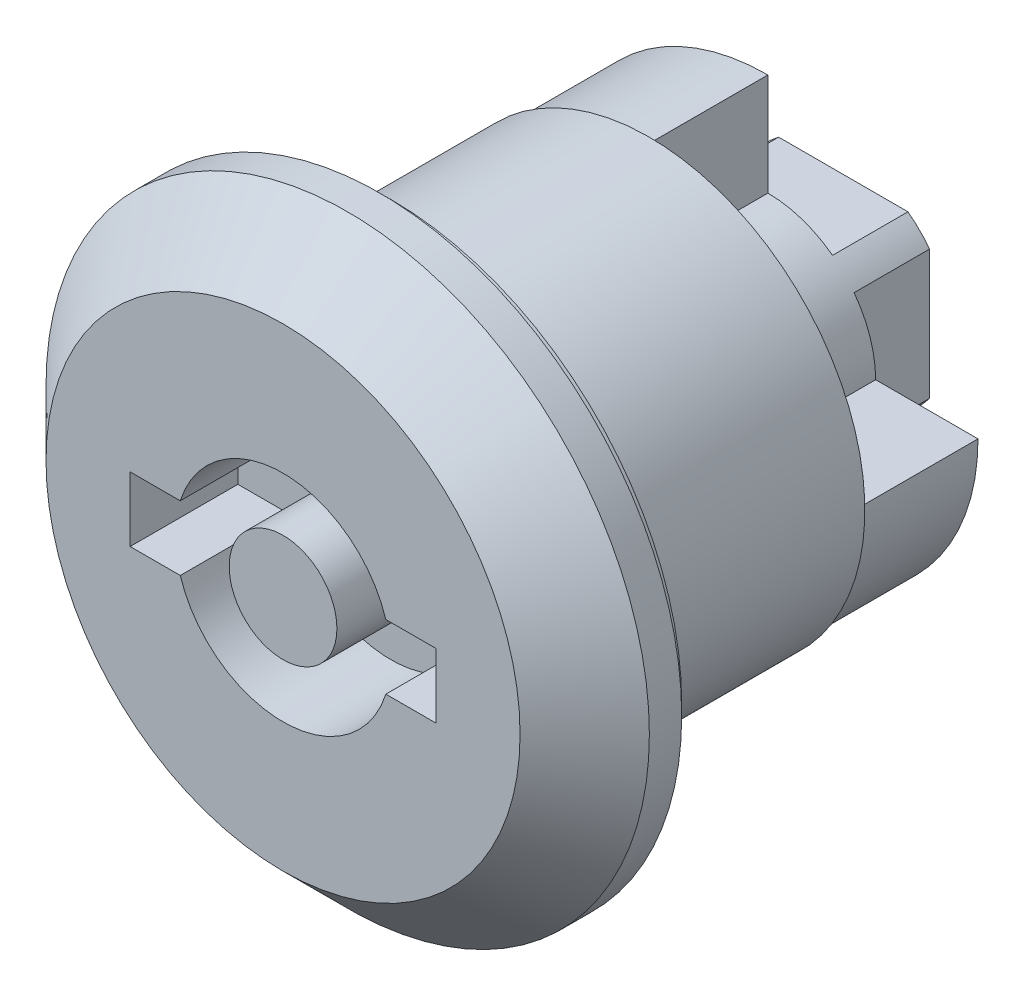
ISO-10303-21;
HEADER;
FILE_DESCRIPTION(('STEP AP214'),'2;1');
FILE_NAME('part.step','',(''),(''),'','','');
FILE_SCHEMA(('AUTOMOTIVE_DESIGN { 1 0 10303 214 1 1 1 1 }'));
ENDSEC;
DATA;
#1=APPLICATION_CONTEXT('core data for automotive mechanical design processes');
#2=APPLICATION_PROTOCOL_DEFINITION('international standard','automotive_design',2000,#1);
#3=PRODUCT_CONTEXT('',#1,'mechanical');
#4=PRODUCT('Part','Part','',(#3));
#5=PRODUCT_RELATED_PRODUCT_CATEGORY('part','',(#4));
#6=PRODUCT_DEFINITION_FORMATION('','',#4);
#7=PRODUCT_DEFINITION_CONTEXT('part definition',#1,'design');
#8=PRODUCT_DEFINITION('design','',#6,#7);
#9=PRODUCT_DEFINITION_SHAPE('','',#8);
#10=(LENGTH_UNIT() NAMED_UNIT(*) SI_UNIT(.MILLI.,.METRE.));
#11=(NAMED_UNIT(*) PLANE_ANGLE_UNIT() SI_UNIT($,.RADIAN.));
#12=(NAMED_UNIT(*) SI_UNIT($,.STERADIAN.) SOLID_ANGLE_UNIT());
#13=UNCERTAINTY_MEASURE_WITH_UNIT(LENGTH_MEASURE(1.E-05),#10,'distance_accuracy_value','');
#14=(GEOMETRIC_REPRESENTATION_CONTEXT(3) GLOBAL_UNCERTAINTY_ASSIGNED_CONTEXT((#13)) GLOBAL_UNIT_ASSIGNED_CONTEXT((#10,
#11,#12)) REPRESENTATION_CONTEXT('',''));
#15=CARTESIAN_POINT('',(0.,0.,0.));
#16=DIRECTION('',(0.,0.,1.));
#17=DIRECTION('',(1.,0.,0.));
#18=AXIS2_PLACEMENT_3D('',#15,#16,#17);
#19=CARTESIAN_POINT('',(0.,0.,-50.));
#20=DIRECTION('',(0.,0.,-1.));
#21=DIRECTION('',(-1.,0.,0.));
#22=AXIS2_PLACEMENT_3D('',#19,#20,#21);
#23=CYLINDRICAL_SURFACE('',#22,5.);
#24=CARTESIAN_POINT('',(0.,0.,-17.5));
#25=DIRECTION('',(0.,0.,-1.));
#26=DIRECTION('',(-1.,0.,0.));
#27=AXIS2_PLACEMENT_3D('',#24,#25,#26);
#28=CIRCLE('',#27,5.);
#29=CARTESIAN_POINT('',(-4.,3.,-17.5));
#30=VERTEX_POINT('',#29);
#31=CARTESIAN_POINT('',(-3.,4.,-17.5));
#32=VERTEX_POINT('',#31);
#33=EDGE_CURVE('E272',#30,#32,#28,.T.);
#34=ORIENTED_EDGE('',*,*,#33,.T.);
#35=DIRECTION('',(0.,0.,-1.));
#36=VECTOR('',#35,1.);
#37=CARTESIAN_POINT('',(-3.,4.,-11.4172374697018));
#38=LINE('',#37,#36);
#39=CARTESIAN_POINT('',(-3.,4.,-21.));
#40=VERTEX_POINT('',#39);
#41=EDGE_CURVE('E292',#32,#40,#38,.T.);
#42=ORIENTED_EDGE('',*,*,#41,.T.);
#43=CARTESIAN_POINT('',(0.,0.,-21.));
#44=DIRECTION('',(0.,0.,-1.));
#45=DIRECTION('',(-1.,0.,0.));
#46=AXIS2_PLACEMENT_3D('',#43,#44,#45);
#47=CIRCLE('',#46,5.);
#48=CARTESIAN_POINT('',(-4.,3.,-21.));
#49=VERTEX_POINT('',#48);
#50=EDGE_CURVE('E276',#49,#40,#47,.T.);
#51=ORIENTED_EDGE('',*,*,#50,.F.);
#52=DIRECTION('',(0.,0.,-1.));
#53=VECTOR('',#52,1.);
#54=CARTESIAN_POINT('',(-4.,3.,-11.4172374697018));
#55=LINE('',#54,#53);
#56=EDGE_CURVE('E289',#30,#49,#55,.T.);
#57=ORIENTED_EDGE('',*,*,#56,.F.);
#58=EDGE_LOOP('',(#34,#42,#51,#57));
#59=FACE_BOUND('',#58,.T.);
#60=ADVANCED_FACE('F14',(#59),#23,.T.);
#61=DIRECTION('',(0.,0.,-1.));
#62=VECTOR('',#61,1.);
#63=CARTESIAN_POINT('',(-3.,-4.,-11.4172374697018));
#64=LINE('',#63,#62);
#65=CARTESIAN_POINT('',(-3.,-4.,-17.5));
#66=VERTEX_POINT('',#65);
#67=CARTESIAN_POINT('',(-3.,-4.,-21.));
#68=VERTEX_POINT('',#67);
#69=EDGE_CURVE('E263',#66,#68,#64,.T.);
#70=ORIENTED_EDGE('',*,*,#69,.F.);
#71=CARTESIAN_POINT('',(-4.,-3.,-17.5));
#72=VERTEX_POINT('',#71);
#73=EDGE_CURVE('E277',#66,#72,#28,.T.);
#74=ORIENTED_EDGE('',*,*,#73,.T.);
#75=DIRECTION('',(0.,0.,-1.));
#76=VECTOR('',#75,1.);
#77=CARTESIAN_POINT('',(-4.,-3.,-11.4172374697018));
#78=LINE('',#77,#76);
#79=CARTESIAN_POINT('',(-4.,-3.,-21.));
#80=VERTEX_POINT('',#79);
#81=EDGE_CURVE('E310',#72,#80,#78,.T.);
#82=ORIENTED_EDGE('',*,*,#81,.T.);
#83=EDGE_CURVE('E273',#68,#80,#47,.T.);
#84=ORIENTED_EDGE('',*,*,#83,.F.);
#85=EDGE_LOOP('',(#70,#74,#82,#84));
#86=FACE_BOUND('',#85,.T.);
#87=ADVANCED_FACE('F221',(#86),#23,.T.);
#88=DIRECTION('',(0.,0.,-1.));
#89=VECTOR('',#88,1.);
#90=CARTESIAN_POINT('',(3.,-4.,-11.4172374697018));
#91=LINE('',#90,#89);
#92=CARTESIAN_POINT('',(3.,-4.,-17.5));
#93=VERTEX_POINT('',#92);
#94=CARTESIAN_POINT('',(3.,-4.,-21.));
#95=VERTEX_POINT('',#94);
#96=EDGE_CURVE('E255',#93,#95,#91,.T.);
#97=ORIENTED_EDGE('',*,*,#96,.T.);
#98=CARTESIAN_POINT('',(4.,-3.,-21.));
#99=VERTEX_POINT('',#98);
#100=EDGE_CURVE('E258',#99,#95,#47,.T.);
#101=ORIENTED_EDGE('',*,*,#100,.F.);
#102=DIRECTION('',(0.,0.,-1.));
#103=VECTOR('',#102,1.);
#104=CARTESIAN_POINT('',(4.,-3.,-11.4172374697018));
#105=LINE('',#104,#103);
#106=CARTESIAN_POINT('',(4.,-3.,-17.5));
#107=VERTEX_POINT('',#106);
#108=EDGE_CURVE('E314',#107,#99,#105,.T.);
#109=ORIENTED_EDGE('',*,*,#108,.F.);
#110=EDGE_CURVE('E260',#107,#93,#28,.T.);
#111=ORIENTED_EDGE('',*,*,#110,.T.);
#112=EDGE_LOOP('',(#97,#101,#109,#111));
#113=FACE_BOUND('',#112,.T.);
#114=ADVANCED_FACE('F229',(#113),#23,.T.);
#115=CARTESIAN_POINT('',(0.,5.,-21.));
#116=DIRECTION('',(0.,0.,1.));
#117=DIRECTION('',(1.,0.,0.));
#118=AXIS2_PLACEMENT_3D('',#115,#116,#117);
#119=PLANE('',#118);
#120=CARTESIAN_POINT('',(0.,0.,-21.));
#121=DIRECTION('',(0.,0.,-1.));
#122=DIRECTION('',(-1.,0.,0.));
#123=AXIS2_PLACEMENT_3D('',#120,#121,#122);
#124=CIRCLE('',#123,3.);
#125=CARTESIAN_POINT('',(-3.,0.,-21.));
#126=VERTEX_POINT('',#125);
#127=EDGE_CURVE('E427',#126,#126,#124,.T.);
#128=ORIENTED_EDGE('',*,*,#127,.F.);
#129=EDGE_LOOP('',(#128));
#130=FACE_BOUND('',#129,.T.);
#131=ORIENTED_EDGE('',*,*,#50,.T.);
#132=DIRECTION('',(-1.,0.,0.));
#133=VECTOR('',#132,1.);
#134=CARTESIAN_POINT('',(3.,4.,-21.));
#135=LINE('',#134,#133);
#136=CARTESIAN_POINT('',(3.,4.,-21.));
#137=VERTEX_POINT('',#136);
#138=EDGE_CURVE('E284',#137,#40,#135,.T.);
#139=ORIENTED_EDGE('',*,*,#138,.F.);
#140=CARTESIAN_POINT('',(4.,3.,-21.));
#141=VERTEX_POINT('',#140);
#142=EDGE_CURVE('E275',#137,#141,#47,.T.);
#143=ORIENTED_EDGE('',*,*,#142,.T.);
#144=DIRECTION('',(0.,-1.,0.));
#145=VECTOR('',#144,1.);
#146=CARTESIAN_POINT('',(4.,3.,-21.));
#147=LINE('',#146,#145);
#148=EDGE_CURVE('E271',#141,#99,#147,.T.);
#149=ORIENTED_EDGE('',*,*,#148,.T.);
#150=ORIENTED_EDGE('',*,*,#100,.T.);
#151=DIRECTION('',(-1.,0.,0.));
#152=VECTOR('',#151,1.);
#153=CARTESIAN_POINT('',(3.,-4.,-21.));
#154=LINE('',#153,#152);
#155=EDGE_CURVE('E262',#95,#68,#154,.T.);
#156=ORIENTED_EDGE('',*,*,#155,.T.);
#157=ORIENTED_EDGE('',*,*,#83,.T.);
#158=DIRECTION('',(0.,-1.,0.));
#159=VECTOR('',#158,1.);
#160=CARTESIAN_POINT('',(-4.,3.,-21.));
#161=LINE('',#160,#159);
#162=EDGE_CURVE('E286',#49,#80,#161,.T.);
#163=ORIENTED_EDGE('',*,*,#162,.F.);
#164=EDGE_LOOP('',(#131,#139,#143,#149,#150,#156,#157,#163));
#165=FACE_BOUND('',#164,.T.);
#166=ADVANCED_FACE('F235',(#130,#165),#119,.F.);
#167=ORIENTED_EDGE('',*,*,#142,.F.);
#168=DIRECTION('',(0.,0.,-1.));
#169=VECTOR('',#168,1.);
#170=CARTESIAN_POINT('',(3.,4.,-11.4172374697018));
#171=LINE('',#170,#169);
#172=CARTESIAN_POINT('',(3.,4.,-17.5));
#173=VERTEX_POINT('',#172);
#174=EDGE_CURVE('E295',#173,#137,#171,.T.);
#175=ORIENTED_EDGE('',*,*,#174,.F.);
#176=CARTESIAN_POINT('',(0.,0.,-17.5));
#177=DIRECTION('',(0.,0.,-1.));
#178=DIRECTION('',(-1.,0.,0.));
#179=AXIS2_PLACEMENT_3D('',#176,#177,#178);
#180=CIRCLE('',#179,5.);
#181=CARTESIAN_POINT('',(0.,5.,-17.5));
#182=VERTEX_POINT('',#181);
#183=EDGE_CURVE('E448',#182,#173,#180,.T.);
#184=ORIENTED_EDGE('',*,*,#183,.F.);
#185=DIRECTION('',(0.,0.,-1.));
#186=VECTOR('',#185,1.);
#187=CARTESIAN_POINT('',(0.,5.,1.78858223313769));
#188=LINE('',#187,#186);
#189=CARTESIAN_POINT('',(0.,5.,-12.));
#190=VERTEX_POINT('',#189);
#191=EDGE_CURVE('E462',#190,#182,#188,.T.);
#192=ORIENTED_EDGE('',*,*,#191,.F.);
#193=CARTESIAN_POINT('',(0.,0.,-12.));
#194=DIRECTION('',(0.,0.,1.));
#195=DIRECTION('',(1.,0.,0.));
#196=AXIS2_PLACEMENT_3D('',#193,#194,#195);
#197=CIRCLE('',#196,5.);
#198=CARTESIAN_POINT('',(5.,0.,-12.));
#199=VERTEX_POINT('',#198);
#200=EDGE_CURVE('E446',#190,#199,#197,.F.);
#201=ORIENTED_EDGE('',*,*,#200,.T.);
#202=DIRECTION('',(0.,0.,-1.));
#203=VECTOR('',#202,1.);
#204=CARTESIAN_POINT('',(5.,0.,1.78858223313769));
#205=LINE('',#204,#203);
#206=CARTESIAN_POINT('',(5.,0.,-17.5));
#207=VERTEX_POINT('',#206);
#208=EDGE_CURVE('E450',#199,#207,#205,.T.);
#209=ORIENTED_EDGE('',*,*,#208,.T.);
#210=CARTESIAN_POINT('',(4.,3.,-17.5));
#211=VERTEX_POINT('',#210);
#212=EDGE_CURVE('E451',#211,#207,#180,.T.);
#213=ORIENTED_EDGE('',*,*,#212,.F.);
#214=DIRECTION('',(0.,0.,-1.));
#215=VECTOR('',#214,1.);
#216=CARTESIAN_POINT('',(4.,3.,-11.4172374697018));
#217=LINE('',#216,#215);
#218=EDGE_CURVE('E317',#211,#141,#217,.T.);
#219=ORIENTED_EDGE('',*,*,#218,.T.);
#220=EDGE_LOOP('',(#167,#175,#184,#192,#201,#209,#213,#219));
#221=FACE_BOUND('',#220,.T.);
#222=ADVANCED_FACE('F224',(#221),#23,.T.);
#223=CARTESIAN_POINT('',(0.,0.,-50.));
#224=DIRECTION('',(0.,0.,-1.));
#225=DIRECTION('',(-1.,0.,0.));
#226=AXIS2_PLACEMENT_3D('',#223,#224,#225);
#227=CYLINDRICAL_SURFACE('',#226,10.);
#228=CARTESIAN_POINT('',(0.,0.,-12.));
#229=DIRECTION('',(0.,0.,-1.));
#230=DIRECTION('',(-1.,0.,0.));
#231=AXIS2_PLACEMENT_3D('',#228,#229,#230);
#232=CIRCLE('',#231,10.);
#233=CARTESIAN_POINT('',(-10.,0.,-12.));
#234=VERTEX_POINT('',#233);
#235=EDGE_CURVE('E9',#234,#234,#232,.T.);
#236=ORIENTED_EDGE('',*,*,#235,.F.);
#237=EDGE_LOOP('',(#236));
#238=FACE_BOUND('',#237,.T.);
#239=CARTESIAN_POINT('',(0.,0.,0.));
#240=DIRECTION('',(0.,0.,-1.));
#241=DIRECTION('',(-1.,0.,0.));
#242=AXIS2_PLACEMENT_3D('',#239,#240,#241);
#243=CIRCLE('',#242,10.);
#244=CARTESIAN_POINT('',(-10.,0.,0.));
#245=VERTEX_POINT('',#244);
#246=EDGE_CURVE('E319',#245,#245,#243,.T.);
#247=ORIENTED_EDGE('',*,*,#246,.T.);
#248=EDGE_LOOP('',(#247));
#249=FACE_BOUND('',#248,.T.);
#250=ADVANCED_FACE('F16',(#238,#249),#227,.T.);
#251=CARTESIAN_POINT('',(0.,10.,-12.));
#252=DIRECTION('',(0.,0.,1.));
#253=DIRECTION('',(1.,0.,0.));
#254=AXIS2_PLACEMENT_3D('',#251,#252,#253);
#255=PLANE('',#254);
#256=CARTESIAN_POINT('',(0.,0.,-12.));
#257=DIRECTION('',(0.,0.,-1.));
#258=DIRECTION('',(-1.,0.,0.));
#259=AXIS2_PLACEMENT_3D('',#256,#257,#258);
#260=CIRCLE('',#259,9.75);
#261=CARTESIAN_POINT('',(9.75,0.,-12.));
#262=VERTEX_POINT('',#261);
#263=CARTESIAN_POINT('',(0.,9.75,-12.));
#264=VERTEX_POINT('',#263);
#265=EDGE_CURVE('E22',#262,#264,#260,.T.);
#266=ORIENTED_EDGE('',*,*,#265,.F.);
#267=DIRECTION('',(1.,0.,0.));
#268=VECTOR('',#267,1.);
#269=CARTESIAN_POINT('',(5.,0.,-12.));
#270=LINE('',#269,#268);
#271=EDGE_CURVE('E455',#199,#262,#270,.T.);
#272=ORIENTED_EDGE('',*,*,#271,.F.);
#273=ORIENTED_EDGE('',*,*,#200,.F.);
#274=DIRECTION('',(0.,1.,0.));
#275=VECTOR('',#274,1.);
#276=CARTESIAN_POINT('',(0.,5.,-12.));
#277=LINE('',#276,#275);
#278=EDGE_CURVE('E456',#190,#264,#277,.T.);
#279=ORIENTED_EDGE('',*,*,#278,.T.);
#280=EDGE_LOOP('',(#266,#272,#273,#279));
#281=FACE_BOUND('',#280,.T.);
#282=ORIENTED_EDGE('',*,*,#235,.T.);
#283=EDGE_LOOP('',(#282));
#284=FACE_BOUND('',#283,.T.);
#285=ADVANCED_FACE('F242',(#281,#284),#255,.F.);
#286=CARTESIAN_POINT('',(0.,0.,-50.));
#287=DIRECTION('',(0.,0.,-1.));
#288=DIRECTION('',(-1.,0.,0.));
#289=AXIS2_PLACEMENT_3D('',#286,#287,#288);
#290=CYLINDRICAL_SURFACE('',#289,9.75);
#291=ORIENTED_EDGE('',*,*,#265,.T.);
#292=DIRECTION('',(0.,0.,-1.));
#293=VECTOR('',#292,1.);
#294=CARTESIAN_POINT('',(0.,9.75,1.78858223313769));
#295=LINE('',#294,#293);
#296=CARTESIAN_POINT('',(0.,9.75,-17.5));
#297=VERTEX_POINT('',#296);
#298=EDGE_CURVE('E458',#264,#297,#295,.T.);
#299=ORIENTED_EDGE('',*,*,#298,.T.);
#300=CARTESIAN_POINT('',(0.,0.,-17.5));
#301=DIRECTION('',(0.,0.,-1.));
#302=DIRECTION('',(-1.,0.,0.));
#303=AXIS2_PLACEMENT_3D('',#300,#301,#302);
#304=CIRCLE('',#303,9.75);
#305=CARTESIAN_POINT('',(9.75,0.,-17.5));
#306=VERTEX_POINT('',#305);
#307=EDGE_CURVE('E474',#306,#297,#304,.T.);
#308=ORIENTED_EDGE('',*,*,#307,.F.);
#309=DIRECTION('',(0.,0.,-1.));
#310=VECTOR('',#309,1.);
#311=CARTESIAN_POINT('',(9.75,0.,1.78858223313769));
#312=LINE('',#311,#310);
#313=EDGE_CURVE('E37',#262,#306,#312,.T.);
#314=ORIENTED_EDGE('',*,*,#313,.F.);
#315=EDGE_LOOP('',(#291,#299,#308,#314));
#316=FACE_BOUND('',#315,.T.);
#317=ADVANCED_FACE('F350',(#316),#290,.T.);
#318=CARTESIAN_POINT('',(0.,9.75,-17.5));
#319=DIRECTION('',(0.,0.,1.));
#320=DIRECTION('',(1.,0.,0.));
#321=AXIS2_PLACEMENT_3D('',#318,#319,#320);
#322=PLANE('',#321);
#323=ORIENTED_EDGE('',*,*,#307,.T.);
#324=DIRECTION('',(0.,1.,0.));
#325=VECTOR('',#324,1.);
#326=CARTESIAN_POINT('',(0.,5.,-17.5));
#327=LINE('',#326,#325);
#328=EDGE_CURVE('E444',#182,#297,#327,.T.);
#329=ORIENTED_EDGE('',*,*,#328,.F.);
#330=ORIENTED_EDGE('',*,*,#183,.T.);
#331=DIRECTION('',(-1.,0.,0.));
#332=VECTOR('',#331,1.);
#333=CARTESIAN_POINT('',(3.,4.,-17.5));
#334=LINE('',#333,#332);
#335=EDGE_CURVE('E296',#173,#32,#334,.T.);
#336=ORIENTED_EDGE('',*,*,#335,.T.);
#337=ORIENTED_EDGE('',*,*,#33,.F.);
#338=DIRECTION('',(0.,-1.,0.));
#339=VECTOR('',#338,1.);
#340=CARTESIAN_POINT('',(-4.,3.,-17.5));
#341=LINE('',#340,#339);
#342=EDGE_CURVE('E307',#30,#72,#341,.T.);
#343=ORIENTED_EDGE('',*,*,#342,.T.);
#344=ORIENTED_EDGE('',*,*,#73,.F.);
#345=DIRECTION('',(-1.,0.,0.));
#346=VECTOR('',#345,1.);
#347=CARTESIAN_POINT('',(3.,-4.,-17.5));
#348=LINE('',#347,#346);
#349=EDGE_CURVE('E303',#93,#66,#348,.T.);
#350=ORIENTED_EDGE('',*,*,#349,.F.);
#351=ORIENTED_EDGE('',*,*,#110,.F.);
#352=DIRECTION('',(0.,-1.,0.));
#353=VECTOR('',#352,1.);
#354=CARTESIAN_POINT('',(4.,3.,-17.5));
#355=LINE('',#354,#353);
#356=EDGE_CURVE('E316',#211,#107,#355,.T.);
#357=ORIENTED_EDGE('',*,*,#356,.F.);
#358=ORIENTED_EDGE('',*,*,#212,.T.);
#359=DIRECTION('',(1.,0.,0.));
#360=VECTOR('',#359,1.);
#361=CARTESIAN_POINT('',(5.,0.,-17.5));
#362=LINE('',#361,#360);
#363=EDGE_CURVE('E447',#207,#306,#362,.T.);
#364=ORIENTED_EDGE('',*,*,#363,.T.);
#365=EDGE_LOOP('',(#323,#329,#330,#336,#337,#343,#344,#350,#351,#357,#358,#364));
#366=FACE_BOUND('',#365,.T.);
#367=ADVANCED_FACE('F341',(#366),#322,.F.);
#368=CARTESIAN_POINT('',(0.,11.,5.));
#369=DIRECTION('',(0.,0.,1.));
#370=DIRECTION('',(1.,0.,0.));
#371=AXIS2_PLACEMENT_3D('',#368,#369,#370);
#372=PLANE('',#371);
#373=DIRECTION('',(0.,-1.,0.));
#374=VECTOR('',#373,1.);
#375=CARTESIAN_POINT('',(-7.095,1.5,5.));
#376=LINE('',#375,#374);
#377=CARTESIAN_POINT('',(-7.095,1.5,5.));
#378=VERTEX_POINT('',#377);
#379=CARTESIAN_POINT('',(-7.095,-1.5,5.));
#380=VERTEX_POINT('',#379);
#381=EDGE_CURVE('E29',#378,#380,#376,.T.);
#382=ORIENTED_EDGE('',*,*,#381,.F.);
#383=DIRECTION('',(1.,0.,0.));
#384=VECTOR('',#383,1.);
#385=CARTESIAN_POINT('',(-7.095,1.5,5.));
#386=LINE('',#385,#384);
#387=CARTESIAN_POINT('',(-4.76969600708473,1.5,5.));
#388=VERTEX_POINT('',#387);
#389=EDGE_CURVE('E183',#378,#388,#386,.T.);
#390=ORIENTED_EDGE('',*,*,#389,.T.);
#391=CARTESIAN_POINT('',(0.,0.,5.));
#392=DIRECTION('',(0.,0.,1.));
#393=DIRECTION('',(1.,0.,0.));
#394=AXIS2_PLACEMENT_3D('',#391,#392,#393);
#395=CIRCLE('',#394,5.);
#396=CARTESIAN_POINT('',(4.76969600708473,1.5,5.));
#397=VERTEX_POINT('',#396);
#398=EDGE_CURVE('E177',#397,#388,#395,.T.);
#399=ORIENTED_EDGE('',*,*,#398,.F.);
#400=DIRECTION('',(1.,0.,0.));
#401=VECTOR('',#400,1.);
#402=CARTESIAN_POINT('',(4.76969600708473,1.5,5.));
#403=LINE('',#402,#401);
#404=CARTESIAN_POINT('',(7.095,1.5,5.));
#405=VERTEX_POINT('',#404);
#406=EDGE_CURVE('E184',#397,#405,#403,.T.);
#407=ORIENTED_EDGE('',*,*,#406,.T.);
#408=DIRECTION('',(0.,1.,0.));
#409=VECTOR('',#408,1.);
#410=CARTESIAN_POINT('',(7.095,-1.5,5.));
#411=LINE('',#410,#409);
#412=CARTESIAN_POINT('',(7.095,-1.5,5.));
#413=VERTEX_POINT('',#412);
#414=EDGE_CURVE('E178',#413,#405,#411,.T.);
#415=ORIENTED_EDGE('',*,*,#414,.F.);
#416=DIRECTION('',(-1.,0.,0.));
#417=VECTOR('',#416,1.);
#418=CARTESIAN_POINT('',(7.095,-1.5,5.));
#419=LINE('',#418,#417);
#420=CARTESIAN_POINT('',(4.76969600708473,-1.5,5.));
#421=VERTEX_POINT('',#420);
#422=EDGE_CURVE('E175',#413,#421,#419,.T.);
#423=ORIENTED_EDGE('',*,*,#422,.T.);
#424=CARTESIAN_POINT('',(-4.76969600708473,-1.5,5.));
#425=VERTEX_POINT('',#424);
#426=EDGE_CURVE('E156',#425,#421,#395,.T.);
#427=ORIENTED_EDGE('',*,*,#426,.F.);
#428=DIRECTION('',(-1.,0.,0.));
#429=VECTOR('',#428,1.);
#430=CARTESIAN_POINT('',(-4.76969600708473,-1.5,5.));
#431=LINE('',#430,#429);
#432=EDGE_CURVE('E167',#425,#380,#431,.T.);
#433=ORIENTED_EDGE('',*,*,#432,.T.);
#434=EDGE_LOOP('',(#382,#390,#399,#407,#415,#423,#427,#433));
#435=FACE_BOUND('',#434,.T.);
#436=CARTESIAN_POINT('',(0.,0.,5.));
#437=DIRECTION('',(0.,0.,-1.));
#438=DIRECTION('',(-1.,0.,0.));
#439=AXIS2_PLACEMENT_3D('',#436,#437,#438);
#440=CIRCLE('',#439,11.);
#441=CARTESIAN_POINT('',(-11.,0.,5.));
#442=VERTEX_POINT('',#441);
#443=EDGE_CURVE('E280',#442,#442,#440,.T.);
#444=ORIENTED_EDGE('',*,*,#443,.F.);
#445=EDGE_LOOP('',(#444));
#446=FACE_BOUND('',#445,.T.);
#447=ADVANCED_FACE('F171',(#435,#446),#372,.T.);
#448=CARTESIAN_POINT('',(0.,0.,5.));
#449=DIRECTION('',(0.,0.,-1.));
#450=DIRECTION('',(-1.,0.,0.));
#451=AXIS2_PLACEMENT_3D('',#448,#449,#450);
#452=CONICAL_SURFACE('',#451,11.,0.785398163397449);
#453=CARTESIAN_POINT('',(0.,0.,2.));
#454=DIRECTION('',(0.,0.,-1.));
#455=DIRECTION('',(-1.,0.,0.));
#456=AXIS2_PLACEMENT_3D('',#453,#454,#455);
#457=CIRCLE('',#456,14.);
#458=CARTESIAN_POINT('',(-14.,0.,2.));
#459=VERTEX_POINT('',#458);
#460=EDGE_CURVE('E334',#459,#459,#457,.T.);
#461=ORIENTED_EDGE('',*,*,#460,.F.);
#462=EDGE_LOOP('',(#461));
#463=FACE_BOUND('',#462,.T.);
#464=ORIENTED_EDGE('',*,*,#443,.T.);
#465=EDGE_LOOP('',(#464));
#466=FACE_BOUND('',#465,.T.);
#467=ADVANCED_FACE('F339',(#463,#466),#452,.T.);
#468=CARTESIAN_POINT('',(0.,0.,-50.));
#469=DIRECTION('',(0.,0.,-1.));
#470=DIRECTION('',(-1.,0.,0.));
#471=AXIS2_PLACEMENT_3D('',#468,#469,#470);
#472=CYLINDRICAL_SURFACE('',#471,14.);
#473=CARTESIAN_POINT('',(0.,0.,0.500000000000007));
#474=DIRECTION('',(0.,0.,-1.));
#475=DIRECTION('',(-1.,0.,0.));
#476=AXIS2_PLACEMENT_3D('',#473,#474,#475);
#477=CIRCLE('',#476,14.);
#478=CARTESIAN_POINT('',(-14.,0.,0.500000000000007));
#479=VERTEX_POINT('',#478);
#480=EDGE_CURVE('E331',#479,#479,#477,.T.);
#481=ORIENTED_EDGE('',*,*,#480,.F.);
#482=EDGE_LOOP('',(#481));
#483=FACE_BOUND('',#482,.T.);
#484=ORIENTED_EDGE('',*,*,#460,.T.);
#485=EDGE_LOOP('',(#484));
#486=FACE_BOUND('',#485,.T.);
#487=ADVANCED_FACE('F347',(#483,#486),#472,.T.);
#488=CARTESIAN_POINT('',(0.,14.,0.50000000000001));
#489=DIRECTION('',(0.,0.,1.));
#490=DIRECTION('',(1.,0.,0.));
#491=AXIS2_PLACEMENT_3D('',#488,#489,#490);
#492=PLANE('',#491);
#493=CARTESIAN_POINT('',(0.,0.,0.500000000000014));
#494=DIRECTION('',(0.,0.,-1.));
#495=DIRECTION('',(-1.,0.,0.));
#496=AXIS2_PLACEMENT_3D('',#493,#494,#495);
#497=CIRCLE('',#496,13.5);
#498=CARTESIAN_POINT('',(-13.5,0.,0.500000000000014));
#499=VERTEX_POINT('',#498);
#500=EDGE_CURVE('E328',#499,#499,#497,.T.);
#501=ORIENTED_EDGE('',*,*,#500,.F.);
#502=EDGE_LOOP('',(#501));
#503=FACE_BOUND('',#502,.T.);
#504=ORIENTED_EDGE('',*,*,#480,.T.);
#505=EDGE_LOOP('',(#504));
#506=FACE_BOUND('',#505,.T.);
#507=ADVANCED_FACE('F355',(#503,#506),#492,.F.);
#508=CARTESIAN_POINT('',(0.,0.,-50.));
#509=DIRECTION('',(0.,0.,-1.));
#510=DIRECTION('',(-1.,0.,0.));
#511=AXIS2_PLACEMENT_3D('',#508,#509,#510);
#512=CYLINDRICAL_SURFACE('',#511,13.5);
#513=ORIENTED_EDGE('',*,*,#500,.T.);
#514=EDGE_LOOP('',(#513));
#515=FACE_BOUND('',#514,.T.);
#516=CARTESIAN_POINT('',(0.,0.,0.));
#517=DIRECTION('',(0.,0.,-1.));
#518=DIRECTION('',(-1.,0.,0.));
#519=AXIS2_PLACEMENT_3D('',#516,#517,#518);
#520=CIRCLE('',#519,13.5);
#521=CARTESIAN_POINT('',(-13.5,0.,0.));
#522=VERTEX_POINT('',#521);
#523=EDGE_CURVE('E325',#522,#522,#520,.T.);
#524=ORIENTED_EDGE('',*,*,#523,.F.);
#525=EDGE_LOOP('',(#524));
#526=FACE_BOUND('',#525,.T.);
#527=ADVANCED_FACE('F359',(#515,#526),#512,.T.);
#528=CARTESIAN_POINT('',(0.,13.5,0.));
#529=DIRECTION('',(0.,0.,1.));
#530=DIRECTION('',(1.,0.,0.));
#531=AXIS2_PLACEMENT_3D('',#528,#529,#530);
#532=PLANE('',#531);
#533=ORIENTED_EDGE('',*,*,#246,.F.);
#534=EDGE_LOOP('',(#533));
#535=FACE_BOUND('',#534,.T.);
#536=ORIENTED_EDGE('',*,*,#523,.T.);
#537=EDGE_LOOP('',(#536));
#538=FACE_BOUND('',#537,.T.);
#539=ADVANCED_FACE('F363',(#535,#538),#532,.F.);
#540=CARTESIAN_POINT('',(4.,3.,-11.4172374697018));
#541=DIRECTION('',(1.,0.,0.));
#542=DIRECTION('',(0.,0.,-1.));
#543=AXIS2_PLACEMENT_3D('',#540,#541,#542);
#544=PLANE('',#543);
#545=ORIENTED_EDGE('',*,*,#356,.T.);
#546=ORIENTED_EDGE('',*,*,#108,.T.);
#547=ORIENTED_EDGE('',*,*,#148,.F.);
#548=ORIENTED_EDGE('',*,*,#218,.F.);
#549=EDGE_LOOP('',(#545,#546,#547,#548));
#550=FACE_BOUND('',#549,.T.);
#551=ADVANCED_FACE('F367',(#550),#544,.T.);
#552=CARTESIAN_POINT('',(-4.,3.,-11.4172374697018));
#553=DIRECTION('',(1.,0.,0.));
#554=DIRECTION('',(0.,0.,-1.));
#555=AXIS2_PLACEMENT_3D('',#552,#553,#554);
#556=PLANE('',#555);
#557=ORIENTED_EDGE('',*,*,#56,.T.);
#558=ORIENTED_EDGE('',*,*,#162,.T.);
#559=ORIENTED_EDGE('',*,*,#81,.F.);
#560=ORIENTED_EDGE('',*,*,#342,.F.);
#561=EDGE_LOOP('',(#557,#558,#559,#560));
#562=FACE_BOUND('',#561,.T.);
#563=ADVANCED_FACE('F371',(#562),#556,.F.);
#564=CARTESIAN_POINT('',(3.,-4.,-11.4172374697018));
#565=DIRECTION('',(0.,-1.,0.));
#566=DIRECTION('',(1.,0.,0.));
#567=AXIS2_PLACEMENT_3D('',#564,#565,#566);
#568=PLANE('',#567);
#569=ORIENTED_EDGE('',*,*,#349,.T.);
#570=ORIENTED_EDGE('',*,*,#69,.T.);
#571=ORIENTED_EDGE('',*,*,#155,.F.);
#572=ORIENTED_EDGE('',*,*,#96,.F.);
#573=EDGE_LOOP('',(#569,#570,#571,#572));
#574=FACE_BOUND('',#573,.T.);
#575=ADVANCED_FACE('F375',(#574),#568,.T.);
#576=CARTESIAN_POINT('',(3.,4.,-11.4172374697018));
#577=DIRECTION('',(0.,-1.,0.));
#578=DIRECTION('',(1.,0.,0.));
#579=AXIS2_PLACEMENT_3D('',#576,#577,#578);
#580=PLANE('',#579);
#581=ORIENTED_EDGE('',*,*,#174,.T.);
#582=ORIENTED_EDGE('',*,*,#138,.T.);
#583=ORIENTED_EDGE('',*,*,#41,.F.);
#584=ORIENTED_EDGE('',*,*,#335,.F.);
#585=EDGE_LOOP('',(#581,#582,#583,#584));
#586=FACE_BOUND('',#585,.T.);
#587=ADVANCED_FACE('F379',(#586),#580,.F.);
#588=CARTESIAN_POINT('',(0.,5.,1.78858223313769));
#589=DIRECTION('',(-1.,0.,0.));
#590=DIRECTION('',(0.,0.,1.));
#591=AXIS2_PLACEMENT_3D('',#588,#589,#590);
#592=PLANE('',#591);
#593=ORIENTED_EDGE('',*,*,#191,.T.);
#594=ORIENTED_EDGE('',*,*,#328,.T.);
#595=ORIENTED_EDGE('',*,*,#298,.F.);
#596=ORIENTED_EDGE('',*,*,#278,.F.);
#597=EDGE_LOOP('',(#593,#594,#595,#596));
#598=FACE_BOUND('',#597,.T.);
#599=ADVANCED_FACE('F382',(#598),#592,.F.);
#600=CARTESIAN_POINT('',(5.,0.,1.78858223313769));
#601=DIRECTION('',(0.,1.,0.));
#602=DIRECTION('',(-1.,0.,0.));
#603=AXIS2_PLACEMENT_3D('',#600,#601,#602);
#604=PLANE('',#603);
#605=ORIENTED_EDGE('',*,*,#271,.T.);
#606=ORIENTED_EDGE('',*,*,#313,.T.);
#607=ORIENTED_EDGE('',*,*,#363,.F.);
#608=ORIENTED_EDGE('',*,*,#208,.F.);
#609=EDGE_LOOP('',(#605,#606,#607,#608));
#610=FACE_BOUND('',#609,.T.);
#611=ADVANCED_FACE('F385',(#610),#604,.T.);
#612=CARTESIAN_POINT('',(0.,0.,-11.));
#613=DIRECTION('',(0.,0.,-1.));
#614=DIRECTION('',(-1.,0.,0.));
#615=AXIS2_PLACEMENT_3D('',#612,#613,#614);
#616=CYLINDRICAL_SURFACE('',#615,3.);
#617=CARTESIAN_POINT('',(0.,0.,-11.));
#618=DIRECTION('',(0.,0.,-1.));
#619=DIRECTION('',(-1.,0.,0.));
#620=AXIS2_PLACEMENT_3D('',#617,#618,#619);
#621=CIRCLE('',#620,3.);
#622=CARTESIAN_POINT('',(-3.,0.,-11.));
#623=VERTEX_POINT('',#622);
#624=EDGE_CURVE('E441',#623,#623,#621,.T.);
#625=ORIENTED_EDGE('',*,*,#624,.F.);
#626=EDGE_LOOP('',(#625));
#627=FACE_BOUND('',#626,.T.);
#628=ORIENTED_EDGE('',*,*,#127,.T.);
#629=EDGE_LOOP('',(#628));
#630=FACE_BOUND('',#629,.T.);
#631=ADVANCED_FACE('F389',(#627,#630),#616,.F.);
#632=CARTESIAN_POINT('',(0.,0.,-11.));
#633=DIRECTION('',(0.,0.,-1.));
#634=DIRECTION('',(-1.,0.,0.));
#635=AXIS2_PLACEMENT_3D('',#632,#633,#634);
#636=PLANE('',#635);
#637=ORIENTED_EDGE('',*,*,#624,.T.);
#638=EDGE_LOOP('',(#637));
#639=FACE_BOUND('',#638,.T.);
#640=ADVANCED_FACE('F390',(#639),#636,.T.);
#641=CARTESIAN_POINT('',(-7.095,1.5,0.));
#642=DIRECTION('',(-1.,0.,0.));
#643=DIRECTION('',(0.,-1.,0.));
#644=AXIS2_PLACEMENT_3D('',#641,#642,#643);
#645=PLANE('',#644);
#646=DIRECTION('',(0.,0.,1.));
#647=VECTOR('',#646,1.);
#648=CARTESIAN_POINT('',(-7.095,1.5,0.));
#649=LINE('',#648,#647);
#650=CARTESIAN_POINT('',(-7.095,1.5,0.));
#651=VERTEX_POINT('',#650);
#652=EDGE_CURVE('E422',#651,#378,#649,.T.);
#653=ORIENTED_EDGE('',*,*,#652,.T.);
#654=ORIENTED_EDGE('',*,*,#381,.T.);
#655=DIRECTION('',(0.,0.,1.));
#656=VECTOR('',#655,1.);
#657=CARTESIAN_POINT('',(-7.095,-1.5,0.));
#658=LINE('',#657,#656);
#659=CARTESIAN_POINT('',(-7.095,-1.5,0.));
#660=VERTEX_POINT('',#659);
#661=EDGE_CURVE('E164',#660,#380,#658,.T.);
#662=ORIENTED_EDGE('',*,*,#661,.F.);
#663=DIRECTION('',(0.,-1.,0.));
#664=VECTOR('',#663,1.);
#665=CARTESIAN_POINT('',(-7.095,1.5,0.));
#666=LINE('',#665,#664);
#667=EDGE_CURVE('E188',#651,#660,#666,.T.);
#668=ORIENTED_EDGE('',*,*,#667,.F.);
#669=EDGE_LOOP('',(#653,#654,#662,#668));
#670=FACE_BOUND('',#669,.T.);
#671=ADVANCED_FACE('F394',(#670),#645,.F.);
#672=CARTESIAN_POINT('',(-7.095,1.5,0.));
#673=DIRECTION('',(0.,-1.,0.));
#674=DIRECTION('',(1.,0.,0.));
#675=AXIS2_PLACEMENT_3D('',#672,#673,#674);
#676=PLANE('',#675);
#677=DIRECTION('',(0.,0.,1.));
#678=VECTOR('',#677,1.);
#679=CARTESIAN_POINT('',(-4.76969600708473,1.5,0.));
#680=LINE('',#679,#678);
#681=CARTESIAN_POINT('',(-4.76969600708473,1.5,0.));
#682=VERTEX_POINT('',#681);
#683=EDGE_CURVE('E428',#682,#388,#680,.T.);
#684=ORIENTED_EDGE('',*,*,#683,.T.);
#685=ORIENTED_EDGE('',*,*,#389,.F.);
#686=ORIENTED_EDGE('',*,*,#652,.F.);
#687=DIRECTION('',(1.,0.,0.));
#688=VECTOR('',#687,1.);
#689=CARTESIAN_POINT('',(-7.095,1.5,0.));
#690=LINE('',#689,#688);
#691=EDGE_CURVE('E430',#651,#682,#690,.T.);
#692=ORIENTED_EDGE('',*,*,#691,.T.);
#693=EDGE_LOOP('',(#684,#685,#686,#692));
#694=FACE_BOUND('',#693,.T.);
#695=ADVANCED_FACE('F398',(#694),#676,.T.);
#696=CARTESIAN_POINT('',(0.,0.,0.));
#697=DIRECTION('',(0.,0.,1.));
#698=DIRECTION('',(1.,0.,0.));
#699=AXIS2_PLACEMENT_3D('',#696,#697,#698);
#700=CYLINDRICAL_SURFACE('',#699,5.);
#701=DIRECTION('',(0.,0.,1.));
#702=VECTOR('',#701,1.);
#703=CARTESIAN_POINT('',(4.76969600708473,1.5,0.));
#704=LINE('',#703,#702);
#705=CARTESIAN_POINT('',(4.76969600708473,1.5,0.));
#706=VERTEX_POINT('',#705);
#707=EDGE_CURVE('E433',#706,#397,#704,.T.);
#708=ORIENTED_EDGE('',*,*,#707,.T.);
#709=ORIENTED_EDGE('',*,*,#398,.T.);
#710=ORIENTED_EDGE('',*,*,#683,.F.);
#711=CARTESIAN_POINT('',(0.,0.,0.));
#712=DIRECTION('',(0.,0.,1.));
#713=DIRECTION('',(1.,0.,0.));
#714=AXIS2_PLACEMENT_3D('',#711,#712,#713);
#715=CIRCLE('',#714,5.);
#716=EDGE_CURVE('E688',#706,#682,#715,.T.);
#717=ORIENTED_EDGE('',*,*,#716,.F.);
#718=EDGE_LOOP('',(#708,#709,#710,#717));
#719=FACE_BOUND('',#718,.T.);
#720=ADVANCED_FACE('F401',(#719),#700,.F.);
#721=CARTESIAN_POINT('',(4.76969600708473,1.5,0.));
#722=DIRECTION('',(0.,-1.,0.));
#723=DIRECTION('',(1.,0.,0.));
#724=AXIS2_PLACEMENT_3D('',#721,#722,#723);
#725=PLANE('',#724);
#726=DIRECTION('',(0.,0.,1.));
#727=VECTOR('',#726,1.);
#728=CARTESIAN_POINT('',(7.095,1.5,0.));
#729=LINE('',#728,#727);
#730=CARTESIAN_POINT('',(7.095,1.5,0.));
#731=VERTEX_POINT('',#730);
#732=EDGE_CURVE('E435',#731,#405,#729,.T.);
#733=ORIENTED_EDGE('',*,*,#732,.T.);
#734=ORIENTED_EDGE('',*,*,#406,.F.);
#735=ORIENTED_EDGE('',*,*,#707,.F.);
#736=DIRECTION('',(1.,0.,0.));
#737=VECTOR('',#736,1.);
#738=CARTESIAN_POINT('',(4.76969600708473,1.5,0.));
#739=LINE('',#738,#737);
#740=EDGE_CURVE('E691',#706,#731,#739,.T.);
#741=ORIENTED_EDGE('',*,*,#740,.T.);
#742=EDGE_LOOP('',(#733,#734,#735,#741));
#743=FACE_BOUND('',#742,.T.);
#744=ADVANCED_FACE('F403',(#743),#725,.T.);
#745=CARTESIAN_POINT('',(7.095,-1.5,0.));
#746=DIRECTION('',(1.,0.,0.));
#747=DIRECTION('',(0.,0.,-1.));
#748=AXIS2_PLACEMENT_3D('',#745,#746,#747);
#749=PLANE('',#748);
#750=DIRECTION('',(0.,0.,1.));
#751=VECTOR('',#750,1.);
#752=CARTESIAN_POINT('',(7.095,-1.5,0.));
#753=LINE('',#752,#751);
#754=CARTESIAN_POINT('',(7.095,-1.5,0.));
#755=VERTEX_POINT('',#754);
#756=EDGE_CURVE('E694',#755,#413,#753,.T.);
#757=ORIENTED_EDGE('',*,*,#756,.T.);
#758=ORIENTED_EDGE('',*,*,#414,.T.);
#759=ORIENTED_EDGE('',*,*,#732,.F.);
#760=DIRECTION('',(0.,1.,0.));
#761=VECTOR('',#760,1.);
#762=CARTESIAN_POINT('',(7.095,-1.5,0.));
#763=LINE('',#762,#761);
#764=EDGE_CURVE('E695',#755,#731,#763,.T.);
#765=ORIENTED_EDGE('',*,*,#764,.F.);
#766=EDGE_LOOP('',(#757,#758,#759,#765));
#767=FACE_BOUND('',#766,.T.);
#768=ADVANCED_FACE('F406',(#767),#749,.F.);
#769=CARTESIAN_POINT('',(7.095,-1.5,0.));
#770=DIRECTION('',(0.,1.,0.));
#771=DIRECTION('',(-1.,0.,0.));
#772=AXIS2_PLACEMENT_3D('',#769,#770,#771);
#773=PLANE('',#772);
#774=DIRECTION('',(0.,0.,1.));
#775=VECTOR('',#774,1.);
#776=CARTESIAN_POINT('',(4.76969600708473,-1.5,0.));
#777=LINE('',#776,#775);
#778=CARTESIAN_POINT('',(4.76969600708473,-1.5,0.));
#779=VERTEX_POINT('',#778);
#780=EDGE_CURVE('E163',#779,#421,#777,.T.);
#781=ORIENTED_EDGE('',*,*,#780,.T.);
#782=ORIENTED_EDGE('',*,*,#422,.F.);
#783=ORIENTED_EDGE('',*,*,#756,.F.);
#784=DIRECTION('',(-1.,0.,0.));
#785=VECTOR('',#784,1.);
#786=CARTESIAN_POINT('',(7.095,-1.5,0.));
#787=LINE('',#786,#785);
#788=EDGE_CURVE('E699',#755,#779,#787,.T.);
#789=ORIENTED_EDGE('',*,*,#788,.T.);
#790=EDGE_LOOP('',(#781,#782,#783,#789));
#791=FACE_BOUND('',#790,.T.);
#792=ADVANCED_FACE('F410',(#791),#773,.T.);
#793=DIRECTION('',(0.,0.,1.));
#794=VECTOR('',#793,1.);
#795=CARTESIAN_POINT('',(-4.76969600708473,-1.5,0.));
#796=LINE('',#795,#794);
#797=CARTESIAN_POINT('',(-4.76969600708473,-1.5,0.));
#798=VERTEX_POINT('',#797);
#799=EDGE_CURVE('E152',#798,#425,#796,.T.);
#800=ORIENTED_EDGE('',*,*,#799,.T.);
#801=ORIENTED_EDGE('',*,*,#426,.T.);
#802=ORIENTED_EDGE('',*,*,#780,.F.);
#803=EDGE_CURVE('E159',#798,#779,#715,.T.);
#804=ORIENTED_EDGE('',*,*,#803,.F.);
#805=EDGE_LOOP('',(#800,#801,#802,#804));
#806=FACE_BOUND('',#805,.T.);
#807=ADVANCED_FACE('F154',(#806),#700,.F.);
#808=CARTESIAN_POINT('',(-4.76969600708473,-1.5,0.));
#809=DIRECTION('',(0.,1.,0.));
#810=DIRECTION('',(-1.,0.,0.));
#811=AXIS2_PLACEMENT_3D('',#808,#809,#810);
#812=PLANE('',#811);
#813=DIRECTION('',(-1.,0.,0.));
#814=VECTOR('',#813,1.);
#815=CARTESIAN_POINT('',(-4.76969600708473,-1.5,0.));
#816=LINE('',#815,#814);
#817=EDGE_CURVE('E708',#798,#660,#816,.T.);
#818=ORIENTED_EDGE('',*,*,#817,.T.);
#819=ORIENTED_EDGE('',*,*,#661,.T.);
#820=ORIENTED_EDGE('',*,*,#432,.F.);
#821=ORIENTED_EDGE('',*,*,#799,.F.);
#822=EDGE_LOOP('',(#818,#819,#820,#821));
#823=FACE_BOUND('',#822,.T.);
#824=ADVANCED_FACE('F168',(#823),#812,.T.);
#825=CARTESIAN_POINT('',(0.,0.,0.));
#826=DIRECTION('',(0.,0.,1.));
#827=DIRECTION('',(1.,0.,0.));
#828=AXIS2_PLACEMENT_3D('',#825,#826,#827);
#829=PLANE('',#828);
#830=CARTESIAN_POINT('',(0.,0.,0.));
#831=DIRECTION('',(0.,0.,1.));
#832=DIRECTION('',(1.,0.,0.));
#833=AXIS2_PLACEMENT_3D('',#830,#831,#832);
#834=CIRCLE('',#833,2.5);
#835=CARTESIAN_POINT('',(2.5,0.,0.));
#836=VERTEX_POINT('',#835);
#837=EDGE_CURVE('E195',#836,#836,#834,.T.);
#838=ORIENTED_EDGE('',*,*,#837,.F.);
#839=EDGE_LOOP('',(#838));
#840=FACE_BOUND('',#839,.T.);
#841=ORIENTED_EDGE('',*,*,#667,.T.);
#842=ORIENTED_EDGE('',*,*,#817,.F.);
#843=ORIENTED_EDGE('',*,*,#803,.T.);
#844=ORIENTED_EDGE('',*,*,#788,.F.);
#845=ORIENTED_EDGE('',*,*,#764,.T.);
#846=ORIENTED_EDGE('',*,*,#740,.F.);
#847=ORIENTED_EDGE('',*,*,#716,.T.);
#848=ORIENTED_EDGE('',*,*,#691,.F.);
#849=EDGE_LOOP('',(#841,#842,#843,#844,#845,#846,#847,#848));
#850=FACE_BOUND('',#849,.T.);
#851=ADVANCED_FACE('F206',(#840,#850),#829,.T.);
#852=CARTESIAN_POINT('',(0.,0.,0.));
#853=DIRECTION('',(0.,0.,1.));
#854=DIRECTION('',(1.,0.,0.));
#855=AXIS2_PLACEMENT_3D('',#852,#853,#854);
#856=CYLINDRICAL_SURFACE('',#855,2.5);
#857=ORIENTED_EDGE('',*,*,#837,.T.);
#858=EDGE_LOOP('',(#857));
#859=FACE_BOUND('',#858,.T.);
#860=CARTESIAN_POINT('',(0.,0.,5.));
#861=DIRECTION('',(0.,0.,1.));
#862=DIRECTION('',(1.,0.,0.));
#863=AXIS2_PLACEMENT_3D('',#860,#861,#862);
#864=CIRCLE('',#863,2.5);
#865=CARTESIAN_POINT('',(2.5,0.,5.));
#866=VERTEX_POINT('',#865);
#867=EDGE_CURVE('E198',#866,#866,#864,.T.);
#868=ORIENTED_EDGE('',*,*,#867,.F.);
#869=EDGE_LOOP('',(#868));
#870=FACE_BOUND('',#869,.T.);
#871=ADVANCED_FACE('F204',(#859,#870),#856,.T.);
#872=ORIENTED_EDGE('',*,*,#867,.T.);
#873=EDGE_LOOP('',(#872));
#874=FACE_BOUND('',#873,.T.);
#875=ADVANCED_FACE('F202',(#874),#372,.T.);
#876=CLOSED_SHELL('',(#60,#87,#114,#166,#222,#250,#285,#317,#367,#447,#467,#487,#507,#527,#539,
#551,#563,#575,#587,#599,#611,#631,#640,#671,#695,#720,#744,#768,#792,#807,#824,#851,#871,#875));
#877=MANIFOLD_SOLID_BREP('B1',#876);
#878=ADVANCED_BREP_SHAPE_REPRESENTATION('',(#18,#877),#14);
#879=SHAPE_DEFINITION_REPRESENTATION(#9,#878);
ENDSEC;
END-ISO-10303-21;
